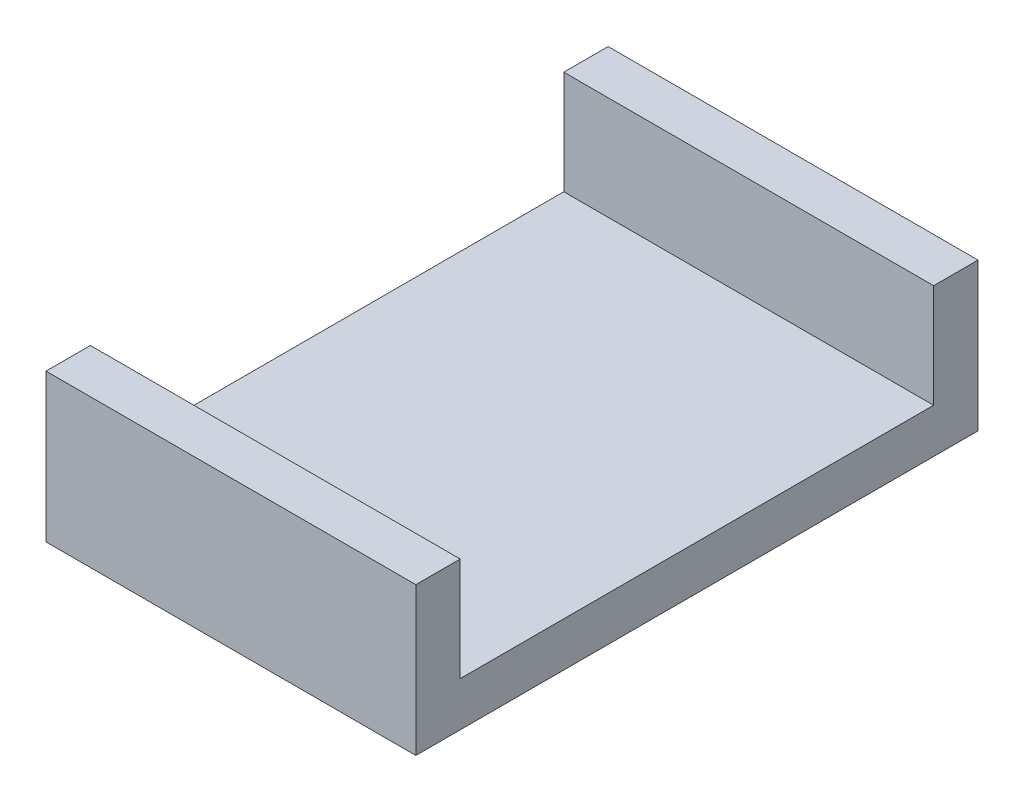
ISO-10303-21;
HEADER;
FILE_DESCRIPTION(('STEP AP214'),'2;1');
FILE_NAME('part.step','',(''),(''),'','','');
FILE_SCHEMA(('AUTOMOTIVE_DESIGN { 1 0 10303 214 1 1 1 1 }'));
ENDSEC;
DATA;
#1=APPLICATION_CONTEXT('core data for automotive mechanical design processes');
#2=APPLICATION_PROTOCOL_DEFINITION('international standard','automotive_design',2000,#1);
#3=PRODUCT_CONTEXT('',#1,'mechanical');
#4=PRODUCT('Part','Part','',(#3));
#5=PRODUCT_RELATED_PRODUCT_CATEGORY('part','',(#4));
#6=PRODUCT_DEFINITION_FORMATION('','',#4);
#7=PRODUCT_DEFINITION_CONTEXT('part definition',#1,'design');
#8=PRODUCT_DEFINITION('design','',#6,#7);
#9=PRODUCT_DEFINITION_SHAPE('','',#8);
#10=(LENGTH_UNIT() NAMED_UNIT(*) SI_UNIT(.MILLI.,.METRE.));
#11=(NAMED_UNIT(*) PLANE_ANGLE_UNIT() SI_UNIT($,.RADIAN.));
#12=(NAMED_UNIT(*) SI_UNIT($,.STERADIAN.) SOLID_ANGLE_UNIT());
#13=UNCERTAINTY_MEASURE_WITH_UNIT(LENGTH_MEASURE(1.E-05),#10,'distance_accuracy_value','');
#14=(GEOMETRIC_REPRESENTATION_CONTEXT(3) GLOBAL_UNCERTAINTY_ASSIGNED_CONTEXT((#13)) GLOBAL_UNIT_ASSIGNED_CONTEXT((#10,
#11,#12)) REPRESENTATION_CONTEXT('',''));
#15=CARTESIAN_POINT('',(0.,0.,0.));
#16=DIRECTION('',(0.,0.,1.));
#17=DIRECTION('',(1.,0.,0.));
#18=AXIS2_PLACEMENT_3D('',#15,#16,#17);
#19=CARTESIAN_POINT('',(25.,22.7925019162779,38.5130549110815));
#20=DIRECTION('',(0.,0.,1.));
#21=DIRECTION('',(1.,0.,0.));
#22=AXIS2_PLACEMENT_3D('',#19,#20,#21);
#23=PLANE('',#22);
#24=DIRECTION('',(0.,1.,0.));
#25=VECTOR('',#24,1.);
#26=CARTESIAN_POINT('',(0.,22.7925019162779,38.5130549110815));
#27=LINE('',#26,#25);
#28=CARTESIAN_POINT('',(0.,22.7925019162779,38.5130549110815));
#29=VERTEX_POINT('',#28);
#30=CARTESIAN_POINT('',(0.,29.7925019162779,38.5130549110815));
#31=VERTEX_POINT('',#30);
#32=EDGE_CURVE('E129',#29,#31,#27,.T.);
#33=ORIENTED_EDGE('',*,*,#32,.T.);
#34=DIRECTION('',(-1.,0.,0.));
#35=VECTOR('',#34,1.);
#36=CARTESIAN_POINT('',(25.,29.7925019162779,38.5130549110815));
#37=LINE('',#36,#35);
#38=CARTESIAN_POINT('',(25.,29.7925019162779,38.5130549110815));
#39=VERTEX_POINT('',#38);
#40=EDGE_CURVE('E11',#39,#31,#37,.T.);
#41=ORIENTED_EDGE('',*,*,#40,.F.);
#42=DIRECTION('',(0.,1.,0.));
#43=VECTOR('',#42,1.);
#44=CARTESIAN_POINT('',(25.,22.7925019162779,38.5130549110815));
#45=LINE('',#44,#43);
#46=CARTESIAN_POINT('',(25.,22.7925019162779,38.5130549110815));
#47=VERTEX_POINT('',#46);
#48=EDGE_CURVE('E143',#47,#39,#45,.T.);
#49=ORIENTED_EDGE('',*,*,#48,.F.);
#50=DIRECTION('',(-1.,0.,0.));
#51=VECTOR('',#50,1.);
#52=CARTESIAN_POINT('',(25.,22.7925019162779,38.5130549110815));
#53=LINE('',#52,#51);
#54=EDGE_CURVE('E125',#47,#29,#53,.T.);
#55=ORIENTED_EDGE('',*,*,#54,.T.);
#56=EDGE_LOOP('',(#33,#41,#49,#55));
#57=FACE_BOUND('',#56,.T.);
#58=ADVANCED_FACE('F33',(#57),#23,.F.);
#59=CARTESIAN_POINT('',(25.,29.7925019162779,38.5130549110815));
#60=DIRECTION('',(0.,-1.,0.));
#61=DIRECTION('',(0.,0.,-1.));
#62=AXIS2_PLACEMENT_3D('',#59,#60,#61);
#63=PLANE('',#62);
#64=DIRECTION('',(0.,0.,1.));
#65=VECTOR('',#64,1.);
#66=CARTESIAN_POINT('',(0.,29.7925019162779,38.5130549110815));
#67=LINE('',#66,#65);
#68=CARTESIAN_POINT('',(0.,29.7925019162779,41.5130549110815));
#69=VERTEX_POINT('',#68);
#70=EDGE_CURVE('E132',#31,#69,#67,.T.);
#71=ORIENTED_EDGE('',*,*,#70,.T.);
#72=DIRECTION('',(-1.,0.,0.));
#73=VECTOR('',#72,1.);
#74=CARTESIAN_POINT('',(25.,29.7925019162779,41.5130549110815));
#75=LINE('',#74,#73);
#76=CARTESIAN_POINT('',(25.,29.7925019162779,41.5130549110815));
#77=VERTEX_POINT('',#76);
#78=EDGE_CURVE('E41',#77,#69,#75,.T.);
#79=ORIENTED_EDGE('',*,*,#78,.F.);
#80=DIRECTION('',(0.,0.,1.));
#81=VECTOR('',#80,1.);
#82=CARTESIAN_POINT('',(25.,29.7925019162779,38.5130549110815));
#83=LINE('',#82,#81);
#84=EDGE_CURVE('E92',#39,#77,#83,.T.);
#85=ORIENTED_EDGE('',*,*,#84,.F.);
#86=ORIENTED_EDGE('',*,*,#40,.T.);
#87=EDGE_LOOP('',(#71,#79,#85,#86));
#88=FACE_BOUND('',#87,.T.);
#89=ADVANCED_FACE('F178',(#88),#63,.F.);
#90=CARTESIAN_POINT('',(25.,29.7925019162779,41.5130549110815));
#91=DIRECTION('',(0.,0.,-1.));
#92=DIRECTION('',(-1.,0.,0.));
#93=AXIS2_PLACEMENT_3D('',#90,#91,#92);
#94=PLANE('',#93);
#95=DIRECTION('',(0.,-1.,0.));
#96=VECTOR('',#95,1.);
#97=CARTESIAN_POINT('',(0.,29.7925019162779,41.5130549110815));
#98=LINE('',#97,#96);
#99=CARTESIAN_POINT('',(0.,19.7925019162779,41.5130549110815));
#100=VERTEX_POINT('',#99);
#101=EDGE_CURVE('E134',#69,#100,#98,.T.);
#102=ORIENTED_EDGE('',*,*,#101,.T.);
#103=DIRECTION('',(-1.,0.,0.));
#104=VECTOR('',#103,1.);
#105=CARTESIAN_POINT('',(25.,19.7925019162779,41.5130549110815));
#106=LINE('',#105,#104);
#107=CARTESIAN_POINT('',(25.,19.7925019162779,41.5130549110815));
#108=VERTEX_POINT('',#107);
#109=EDGE_CURVE('E150',#108,#100,#106,.T.);
#110=ORIENTED_EDGE('',*,*,#109,.F.);
#111=DIRECTION('',(0.,-1.,0.));
#112=VECTOR('',#111,1.);
#113=CARTESIAN_POINT('',(25.,29.7925019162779,41.5130549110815));
#114=LINE('',#113,#112);
#115=EDGE_CURVE('E158',#77,#108,#114,.T.);
#116=ORIENTED_EDGE('',*,*,#115,.F.);
#117=ORIENTED_EDGE('',*,*,#78,.T.);
#118=EDGE_LOOP('',(#102,#110,#116,#117));
#119=FACE_BOUND('',#118,.T.);
#120=ADVANCED_FACE('F156',(#119),#94,.F.);
#121=CARTESIAN_POINT('',(25.,19.7925019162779,41.5130549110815));
#122=DIRECTION('',(0.,1.,0.));
#123=DIRECTION('',(0.,0.,1.));
#124=AXIS2_PLACEMENT_3D('',#121,#122,#123);
#125=PLANE('',#124);
#126=DIRECTION('',(0.,0.,-1.));
#127=VECTOR('',#126,1.);
#128=CARTESIAN_POINT('',(0.,19.7925019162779,41.5130549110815));
#129=LINE('',#128,#127);
#130=CARTESIAN_POINT('',(0.,19.7925019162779,3.51305491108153));
#131=VERTEX_POINT('',#130);
#132=EDGE_CURVE('E136',#100,#131,#129,.T.);
#133=ORIENTED_EDGE('',*,*,#132,.T.);
#134=DIRECTION('',(-1.,0.,0.));
#135=VECTOR('',#134,1.);
#136=CARTESIAN_POINT('',(25.,19.7925019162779,3.51305491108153));
#137=LINE('',#136,#135);
#138=CARTESIAN_POINT('',(25.,19.7925019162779,3.51305491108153));
#139=VERTEX_POINT('',#138);
#140=EDGE_CURVE('E147',#139,#131,#137,.T.);
#141=ORIENTED_EDGE('',*,*,#140,.F.);
#142=DIRECTION('',(0.,0.,-1.));
#143=VECTOR('',#142,1.);
#144=CARTESIAN_POINT('',(25.,19.7925019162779,41.5130549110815));
#145=LINE('',#144,#143);
#146=EDGE_CURVE('E170',#108,#139,#145,.T.);
#147=ORIENTED_EDGE('',*,*,#146,.F.);
#148=ORIENTED_EDGE('',*,*,#109,.T.);
#149=EDGE_LOOP('',(#133,#141,#147,#148));
#150=FACE_BOUND('',#149,.T.);
#151=ADVANCED_FACE('F166',(#150),#125,.F.);
#152=CARTESIAN_POINT('',(25.,19.7925019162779,3.51305491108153));
#153=DIRECTION('',(0.,0.,1.));
#154=DIRECTION('',(1.,0.,0.));
#155=AXIS2_PLACEMENT_3D('',#152,#153,#154);
#156=PLANE('',#155);
#157=DIRECTION('',(0.,1.,0.));
#158=VECTOR('',#157,1.);
#159=CARTESIAN_POINT('',(0.,19.7925019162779,3.51305491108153));
#160=LINE('',#159,#158);
#161=CARTESIAN_POINT('',(0.,29.7925019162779,3.51305491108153));
#162=VERTEX_POINT('',#161);
#163=EDGE_CURVE('E138',#131,#162,#160,.T.);
#164=ORIENTED_EDGE('',*,*,#163,.T.);
#165=DIRECTION('',(-1.,0.,0.));
#166=VECTOR('',#165,1.);
#167=CARTESIAN_POINT('',(25.,29.7925019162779,3.51305491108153));
#168=LINE('',#167,#166);
#169=CARTESIAN_POINT('',(25.,29.7925019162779,3.51305491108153));
#170=VERTEX_POINT('',#169);
#171=EDGE_CURVE('E120',#170,#162,#168,.T.);
#172=ORIENTED_EDGE('',*,*,#171,.F.);
#173=DIRECTION('',(0.,1.,0.));
#174=VECTOR('',#173,1.);
#175=CARTESIAN_POINT('',(25.,19.7925019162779,3.51305491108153));
#176=LINE('',#175,#174);
#177=EDGE_CURVE('E111',#139,#170,#176,.T.);
#178=ORIENTED_EDGE('',*,*,#177,.F.);
#179=ORIENTED_EDGE('',*,*,#140,.T.);
#180=EDGE_LOOP('',(#164,#172,#178,#179));
#181=FACE_BOUND('',#180,.T.);
#182=ADVANCED_FACE('F169',(#181),#156,.F.);
#183=CARTESIAN_POINT('',(25.,29.7925019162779,6.51305491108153));
#184=DIRECTION('',(0.,-1.,0.));
#185=DIRECTION('',(0.,0.,-1.));
#186=AXIS2_PLACEMENT_3D('',#183,#184,#185);
#187=PLANE('',#186);
#188=DIRECTION('',(0.,0.,1.));
#189=VECTOR('',#188,1.);
#190=CARTESIAN_POINT('',(0.,29.7925019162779,6.51305491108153));
#191=LINE('',#190,#189);
#192=CARTESIAN_POINT('',(0.,29.7925019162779,6.51305491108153));
#193=VERTEX_POINT('',#192);
#194=EDGE_CURVE('E119',#162,#193,#191,.T.);
#195=ORIENTED_EDGE('',*,*,#194,.T.);
#196=DIRECTION('',(-1.,0.,0.));
#197=VECTOR('',#196,1.);
#198=CARTESIAN_POINT('',(25.,29.7925019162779,6.51305491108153));
#199=LINE('',#198,#197);
#200=CARTESIAN_POINT('',(25.,29.7925019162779,6.51305491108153));
#201=VERTEX_POINT('',#200);
#202=EDGE_CURVE('E116',#201,#193,#199,.T.);
#203=ORIENTED_EDGE('',*,*,#202,.F.);
#204=DIRECTION('',(0.,0.,1.));
#205=VECTOR('',#204,1.);
#206=CARTESIAN_POINT('',(25.,29.7925019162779,6.51305491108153));
#207=LINE('',#206,#205);
#208=EDGE_CURVE('E105',#170,#201,#207,.T.);
#209=ORIENTED_EDGE('',*,*,#208,.F.);
#210=ORIENTED_EDGE('',*,*,#171,.T.);
#211=EDGE_LOOP('',(#195,#203,#209,#210));
#212=FACE_BOUND('',#211,.T.);
#213=ADVANCED_FACE('F117',(#212),#187,.F.);
#214=CARTESIAN_POINT('',(25.,22.7925019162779,6.51305491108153));
#215=DIRECTION('',(0.,0.,-1.));
#216=DIRECTION('',(-1.,0.,0.));
#217=AXIS2_PLACEMENT_3D('',#214,#215,#216);
#218=PLANE('',#217);
#219=DIRECTION('',(0.,-1.,0.));
#220=VECTOR('',#219,1.);
#221=CARTESIAN_POINT('',(0.,22.7925019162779,6.51305491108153));
#222=LINE('',#221,#220);
#223=CARTESIAN_POINT('',(0.,22.7925019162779,6.51305491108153));
#224=VERTEX_POINT('',#223);
#225=EDGE_CURVE('E78',#193,#224,#222,.T.);
#226=ORIENTED_EDGE('',*,*,#225,.T.);
#227=DIRECTION('',(-1.,0.,0.));
#228=VECTOR('',#227,1.);
#229=CARTESIAN_POINT('',(25.,22.7925019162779,6.51305491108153));
#230=LINE('',#229,#228);
#231=CARTESIAN_POINT('',(25.,22.7925019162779,6.51305491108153));
#232=VERTEX_POINT('',#231);
#233=EDGE_CURVE('E121',#232,#224,#230,.T.);
#234=ORIENTED_EDGE('',*,*,#233,.F.);
#235=DIRECTION('',(0.,-1.,0.));
#236=VECTOR('',#235,1.);
#237=CARTESIAN_POINT('',(25.,22.7925019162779,6.51305491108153));
#238=LINE('',#237,#236);
#239=EDGE_CURVE('E109',#201,#232,#238,.T.);
#240=ORIENTED_EDGE('',*,*,#239,.F.);
#241=ORIENTED_EDGE('',*,*,#202,.T.);
#242=EDGE_LOOP('',(#226,#234,#240,#241));
#243=FACE_BOUND('',#242,.T.);
#244=ADVANCED_FACE('F123',(#243),#218,.F.);
#245=CARTESIAN_POINT('',(25.,22.7925019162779,38.5130549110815));
#246=DIRECTION('',(0.,-1.,0.));
#247=DIRECTION('',(0.,0.,-1.));
#248=AXIS2_PLACEMENT_3D('',#245,#246,#247);
#249=PLANE('',#248);
#250=DIRECTION('',(0.,0.,1.));
#251=VECTOR('',#250,1.);
#252=CARTESIAN_POINT('',(0.,22.7925019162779,38.5130549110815));
#253=LINE('',#252,#251);
#254=EDGE_CURVE('E84',#224,#29,#253,.T.);
#255=ORIENTED_EDGE('',*,*,#254,.T.);
#256=ORIENTED_EDGE('',*,*,#54,.F.);
#257=DIRECTION('',(0.,0.,1.));
#258=VECTOR('',#257,1.);
#259=CARTESIAN_POINT('',(25.,22.7925019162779,38.5130549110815));
#260=LINE('',#259,#258);
#261=EDGE_CURVE('E49',#232,#47,#260,.T.);
#262=ORIENTED_EDGE('',*,*,#261,.F.);
#263=ORIENTED_EDGE('',*,*,#233,.T.);
#264=EDGE_LOOP('',(#255,#256,#262,#263));
#265=FACE_BOUND('',#264,.T.);
#266=ADVANCED_FACE('F194',(#265),#249,.F.);
#267=CARTESIAN_POINT('',(25.,29.7925019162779,38.5130549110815));
#268=DIRECTION('',(1.,0.,0.));
#269=DIRECTION('',(0.,0.,-1.));
#270=AXIS2_PLACEMENT_3D('',#267,#268,#269);
#271=PLANE('',#270);
#272=ORIENTED_EDGE('',*,*,#48,.T.);
#273=ORIENTED_EDGE('',*,*,#84,.T.);
#274=ORIENTED_EDGE('',*,*,#115,.T.);
#275=ORIENTED_EDGE('',*,*,#146,.T.);
#276=ORIENTED_EDGE('',*,*,#177,.T.);
#277=ORIENTED_EDGE('',*,*,#208,.T.);
#278=ORIENTED_EDGE('',*,*,#239,.T.);
#279=ORIENTED_EDGE('',*,*,#261,.T.);
#280=EDGE_LOOP('',(#272,#273,#274,#275,#276,#277,#278,#279));
#281=FACE_BOUND('',#280,.T.);
#282=ADVANCED_FACE('F107',(#281),#271,.T.);
#283=CARTESIAN_POINT('',(0.,29.7925019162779,38.5130549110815));
#284=DIRECTION('',(1.,0.,0.));
#285=DIRECTION('',(0.,0.,-1.));
#286=AXIS2_PLACEMENT_3D('',#283,#284,#285);
#287=PLANE('',#286);
#288=ORIENTED_EDGE('',*,*,#32,.F.);
#289=ORIENTED_EDGE('',*,*,#254,.F.);
#290=ORIENTED_EDGE('',*,*,#225,.F.);
#291=ORIENTED_EDGE('',*,*,#194,.F.);
#292=ORIENTED_EDGE('',*,*,#163,.F.);
#293=ORIENTED_EDGE('',*,*,#132,.F.);
#294=ORIENTED_EDGE('',*,*,#101,.F.);
#295=ORIENTED_EDGE('',*,*,#70,.F.);
#296=EDGE_LOOP('',(#288,#289,#290,#291,#292,#293,#294,#295));
#297=FACE_BOUND('',#296,.T.);
#298=ADVANCED_FACE('F162',(#297),#287,.F.);
#299=CLOSED_SHELL('',(#58,#89,#120,#151,#182,#213,#244,#266,#282,#298));
#300=MANIFOLD_SOLID_BREP('B2',#299);
#301=ADVANCED_BREP_SHAPE_REPRESENTATION('',(#18,#300),#14);
#302=SHAPE_DEFINITION_REPRESENTATION(#9,#301);
ENDSEC;
END-ISO-10303-21;
